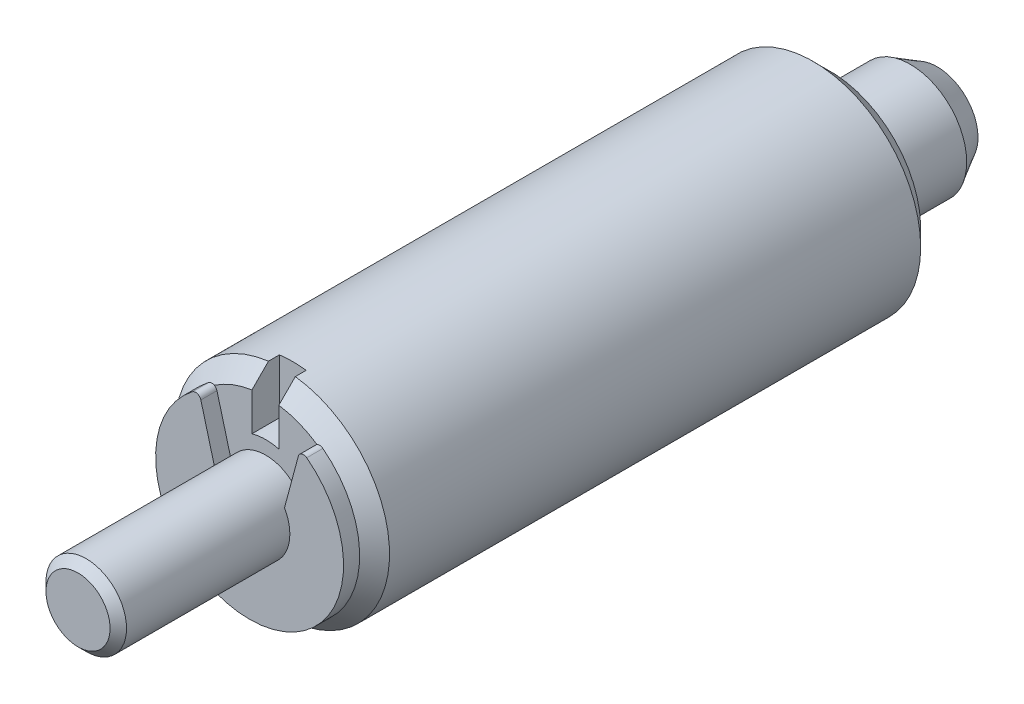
ISO-10303-21;
HEADER;
FILE_DESCRIPTION(('STEP AP214'),'2;1');
FILE_NAME('part.step','',(''),(''),'','','');
FILE_SCHEMA(('AUTOMOTIVE_DESIGN { 1 0 10303 214 1 1 1 1 }'));
ENDSEC;
DATA;
#1=APPLICATION_CONTEXT('core data for automotive mechanical design processes');
#2=APPLICATION_PROTOCOL_DEFINITION('international standard','automotive_design',2000,#1);
#3=PRODUCT_CONTEXT('',#1,'mechanical');
#4=PRODUCT('Part','Part','',(#3));
#5=PRODUCT_RELATED_PRODUCT_CATEGORY('part','',(#4));
#6=PRODUCT_DEFINITION_FORMATION('','',#4);
#7=PRODUCT_DEFINITION_CONTEXT('part definition',#1,'design');
#8=PRODUCT_DEFINITION('design','',#6,#7);
#9=PRODUCT_DEFINITION_SHAPE('','',#8);
#10=(LENGTH_UNIT() NAMED_UNIT(*) SI_UNIT(.MILLI.,.METRE.));
#11=(NAMED_UNIT(*) PLANE_ANGLE_UNIT() SI_UNIT($,.RADIAN.));
#12=(NAMED_UNIT(*) SI_UNIT($,.STERADIAN.) SOLID_ANGLE_UNIT());
#13=UNCERTAINTY_MEASURE_WITH_UNIT(LENGTH_MEASURE(1.E-05),#10,'distance_accuracy_value','');
#14=(GEOMETRIC_REPRESENTATION_CONTEXT(3) GLOBAL_UNCERTAINTY_ASSIGNED_CONTEXT((#13)) GLOBAL_UNIT_ASSIGNED_CONTEXT((#10,
#11,#12)) REPRESENTATION_CONTEXT('',''));
#15=CARTESIAN_POINT('',(0.,0.,0.));
#16=DIRECTION('',(0.,0.,1.));
#17=DIRECTION('',(1.,0.,0.));
#18=AXIS2_PLACEMENT_3D('',#15,#16,#17);
#19=CARTESIAN_POINT('',(-2.00819634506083,2.61861555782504,21.01));
#20=DIRECTION('',(0.,0.,1.));
#21=DIRECTION('',(1.,0.,0.));
#22=AXIS2_PLACEMENT_3D('',#19,#20,#21);
#23=PLANE('',#22);
#24=CARTESIAN_POINT('',(0.,0.,21.01));
#25=DIRECTION('',(0.,0.,1.));
#26=DIRECTION('',(1.,0.,0.));
#27=AXIS2_PLACEMENT_3D('',#24,#25,#26);
#28=CIRCLE('',#27,2.);
#29=CARTESIAN_POINT('',(0.49,-1.939046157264,21.01));
#30=VERTEX_POINT('',#29);
#31=CARTESIAN_POINT('',(-0.51,-1.93388210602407,21.01));
#32=VERTEX_POINT('',#31);
#33=EDGE_CURVE('E9',#30,#32,#28,.F.);
#34=ORIENTED_EDGE('',*,*,#33,.F.);
#35=DIRECTION('',(0.,1.,0.));
#36=VECTOR('',#35,1.);
#37=CARTESIAN_POINT('',(0.49,-3.96987405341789,21.01));
#38=LINE('',#37,#36);
#39=CARTESIAN_POINT('',(0.49,-3.35086291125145,21.01));
#40=VERTEX_POINT('',#39);
#41=EDGE_CURVE('E359',#40,#30,#38,.T.);
#42=ORIENTED_EDGE('',*,*,#41,.F.);
#43=CARTESIAN_POINT('',(0.,0.,21.01));
#44=DIRECTION('',(0.,0.,-1.));
#45=DIRECTION('',(0.,1.,0.));
#46=AXIS2_PLACEMENT_3D('',#43,#44,#45);
#47=CIRCLE('',#46,3.3865);
#48=CARTESIAN_POINT('',(1.9129337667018,2.79447072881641,21.01));
#49=VERTEX_POINT('',#48);
#50=EDGE_CURVE('E174',#49,#40,#47,.T.);
#51=ORIENTED_EDGE('',*,*,#50,.F.);
#52=CARTESIAN_POINT('',(2.00819634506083,2.61861555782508,21.01));
#53=DIRECTION('',(0.,0.,1.));
#54=DIRECTION('',(1.,0.,0.));
#55=AXIS2_PLACEMENT_3D('',#52,#53,#54);
#56=CIRCLE('',#55,0.199999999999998);
#57=CARTESIAN_POINT('',(2.12990521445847,2.7773195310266,21.01));
#58=VERTEX_POINT('',#57);
#59=EDGE_CURVE('E328',#58,#49,#56,.T.);
#60=ORIENTED_EDGE('',*,*,#59,.F.);
#61=CARTESIAN_POINT('',(0.,0.,21.01));
#62=DIRECTION('',(0.,0.,1.));
#63=DIRECTION('',(1.,0.,0.));
#64=AXIS2_PLACEMENT_3D('',#61,#62,#63);
#65=CIRCLE('',#64,3.49999999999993);
#66=CARTESIAN_POINT('',(-2.12990521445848,2.77731953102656,21.01));
#67=VERTEX_POINT('',#66);
#68=EDGE_CURVE('E317',#67,#58,#65,.T.);
#69=ORIENTED_EDGE('',*,*,#68,.F.);
#70=CARTESIAN_POINT('',(-2.00819634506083,2.61861555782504,21.01));
#71=DIRECTION('',(0.,0.,1.));
#72=DIRECTION('',(1.,0.,0.));
#73=AXIS2_PLACEMENT_3D('',#70,#71,#72);
#74=CIRCLE('',#73,0.200000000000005);
#75=CARTESIAN_POINT('',(-1.91293376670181,2.79447072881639,21.01));
#76=VERTEX_POINT('',#75);
#77=EDGE_CURVE('E400',#76,#67,#74,.T.);
#78=ORIENTED_EDGE('',*,*,#77,.F.);
#79=CARTESIAN_POINT('',(0.,0.,21.01));
#80=DIRECTION('',(0.,0.,1.));
#81=DIRECTION('',(1.,0.,0.));
#82=AXIS2_PLACEMENT_3D('',#79,#80,#81);
#83=CIRCLE('',#82,3.3865);
#84=CARTESIAN_POINT('',(-0.51,-3.34787727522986,21.01));
#85=VERTEX_POINT('',#84);
#86=EDGE_CURVE('E37',#85,#76,#83,.F.);
#87=ORIENTED_EDGE('',*,*,#86,.F.);
#88=DIRECTION('',(0.,1.,0.));
#89=VECTOR('',#88,1.);
#90=CARTESIAN_POINT('',(-0.51,-3.96735428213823,21.01));
#91=LINE('',#90,#89);
#92=EDGE_CURVE('E168',#32,#85,#91,.F.);
#93=ORIENTED_EDGE('',*,*,#92,.F.);
#94=EDGE_LOOP('',(#34,#42,#51,#60,#69,#78,#87,#93));
#95=FACE_BOUND('',#94,.T.);
#96=ADVANCED_FACE('F14',(#95),#23,.F.);
#97=CARTESIAN_POINT('',(0.49,1.32202852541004,21.01));
#98=DIRECTION('',(0.,0.,1.));
#99=DIRECTION('',(1.,0.,0.));
#100=AXIS2_PLACEMENT_3D('',#97,#98,#99);
#101=PLANE('',#100);
#102=DIRECTION('',(-0.25881904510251,-0.965925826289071,0.));
#103=VECTOR('',#102,1.);
#104=CARTESIAN_POINT('',(1.30000000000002,0.748331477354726,21.01));
#105=LINE('',#104,#103);
#106=CARTESIAN_POINT('',(1.81501117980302,2.67037936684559,21.01));
#107=VERTEX_POINT('',#106);
#108=CARTESIAN_POINT('',(1.3,0.748331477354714,21.01));
#109=VERTEX_POINT('',#108);
#110=EDGE_CURVE('E334',#107,#109,#105,.T.);
#111=ORIENTED_EDGE('',*,*,#110,.F.);
#112=EDGE_CURVE('E324',#49,#107,#56,.T.);
#113=ORIENTED_EDGE('',*,*,#112,.F.);
#114=CARTESIAN_POINT('',(0.49,3.3508629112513,21.01));
#115=VERTEX_POINT('',#114);
#116=EDGE_CURVE('E22',#115,#49,#47,.T.);
#117=ORIENTED_EDGE('',*,*,#116,.F.);
#118=DIRECTION('',(0.,1.,0.));
#119=VECTOR('',#118,1.);
#120=CARTESIAN_POINT('',(0.49,1.93904615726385,21.01));
#121=LINE('',#120,#119);
#122=CARTESIAN_POINT('',(0.490000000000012,1.9390461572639,21.01));
#123=VERTEX_POINT('',#122);
#124=EDGE_CURVE('E148',#123,#115,#121,.T.);
#125=ORIENTED_EDGE('',*,*,#124,.F.);
#126=CARTESIAN_POINT('',(0.,0.,21.01));
#127=DIRECTION('',(0.,0.,1.));
#128=DIRECTION('',(1.,0.,0.));
#129=AXIS2_PLACEMENT_3D('',#126,#127,#128);
#130=CIRCLE('',#129,2.);
#131=CARTESIAN_POINT('',(-0.510000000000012,1.93388210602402,21.01));
#132=VERTEX_POINT('',#131);
#133=EDGE_CURVE('E133',#123,#132,#130,.T.);
#134=ORIENTED_EDGE('',*,*,#133,.T.);
#135=DIRECTION('',(0.,1.,0.));
#136=VECTOR('',#135,1.);
#137=CARTESIAN_POINT('',(-0.51,1.33412892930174,21.01));
#138=LINE('',#137,#136);
#139=CARTESIAN_POINT('',(-0.51,3.34787727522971,21.01));
#140=VERTEX_POINT('',#139);
#141=EDGE_CURVE('E357',#132,#140,#138,.T.);
#142=ORIENTED_EDGE('',*,*,#141,.T.);
#143=CARTESIAN_POINT('',(0.,0.,21.01));
#144=DIRECTION('',(0.,0.,-1.));
#145=DIRECTION('',(0.,1.,0.));
#146=AXIS2_PLACEMENT_3D('',#143,#144,#145);
#147=CIRCLE('',#146,3.3865);
#148=EDGE_CURVE('E175',#140,#76,#147,.F.);
#149=ORIENTED_EDGE('',*,*,#148,.T.);
#150=CARTESIAN_POINT('',(-1.81501117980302,2.67037936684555,21.01));
#151=VERTEX_POINT('',#150);
#152=EDGE_CURVE('E325',#151,#76,#74,.T.);
#153=ORIENTED_EDGE('',*,*,#152,.F.);
#154=DIRECTION('',(-0.258819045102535,0.965925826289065,0.));
#155=VECTOR('',#154,1.);
#156=CARTESIAN_POINT('',(-1.29999999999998,0.748331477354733,21.01));
#157=LINE('',#156,#155);
#158=CARTESIAN_POINT('',(-1.29999999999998,0.748331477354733,21.01));
#159=VERTEX_POINT('',#158);
#160=EDGE_CURVE('E29',#159,#151,#157,.T.);
#161=ORIENTED_EDGE('',*,*,#160,.F.);
#162=CARTESIAN_POINT('',(0.,0.,21.01));
#163=DIRECTION('',(0.,0.,1.));
#164=DIRECTION('',(1.,0.,0.));
#165=AXIS2_PLACEMENT_3D('',#162,#163,#164);
#166=CIRCLE('',#165,1.5);
#167=EDGE_CURVE('E144',#159,#109,#166,.F.);
#168=ORIENTED_EDGE('',*,*,#167,.T.);
#169=EDGE_LOOP('',(#111,#113,#117,#125,#134,#142,#149,#153,#161,#168));
#170=FACE_BOUND('',#169,.T.);
#171=ADVANCED_FACE('F150',(#170),#101,.T.);
#172=CARTESIAN_POINT('',(1.52264973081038,-1.54092574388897,-4.));
#173=DIRECTION('',(0.,0.,-1.));
#174=DIRECTION('',(-1.,0.,0.));
#175=AXIS2_PLACEMENT_3D('',#172,#173,#174);
#176=PLANE('',#175);
#177=CARTESIAN_POINT('',(0.,0.,-4.));
#178=DIRECTION('',(0.,0.,1.));
#179=DIRECTION('',(0.,-1.,0.));
#180=AXIS2_PLACEMENT_3D('',#177,#178,#179);
#181=CIRCLE('',#180,1.52264973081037);
#182=CARTESIAN_POINT('',(0.,-1.52264973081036,-4.00000000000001));
#183=VERTEX_POINT('',#182);
#184=EDGE_CURVE('E249',#183,#183,#181,.T.);
#185=ORIENTED_EDGE('',*,*,#184,.F.);
#186=EDGE_LOOP('',(#185));
#187=FACE_BOUND('',#186,.T.);
#188=ADVANCED_FACE('F16',(#187),#176,.T.);
#189=CARTESIAN_POINT('',(0.49,1.93904615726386,19.99));
#190=DIRECTION('',(-1.,0.,0.));
#191=DIRECTION('',(0.,0.,1.));
#192=AXIS2_PLACEMENT_3D('',#189,#190,#191);
#193=PLANE('',#192);
#194=DIRECTION('',(0.,0.,-1.));
#195=VECTOR('',#194,1.);
#196=CARTESIAN_POINT('',(0.49,3.96987405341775,20.5));
#197=LINE('',#196,#195);
#198=CARTESIAN_POINT('',(0.49,3.96987405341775,20.3965));
#199=VERTEX_POINT('',#198);
#200=CARTESIAN_POINT('',(0.49,3.96987405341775,19.99));
#201=VERTEX_POINT('',#200);
#202=EDGE_CURVE('E166',#199,#201,#197,.T.);
#203=ORIENTED_EDGE('',*,*,#202,.T.);
#204=DIRECTION('',(0.,1.,0.));
#205=VECTOR('',#204,1.);
#206=CARTESIAN_POINT('',(0.49,1.93388210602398,19.99));
#207=LINE('',#206,#205);
#208=CARTESIAN_POINT('',(0.490000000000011,1.9390461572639,19.99));
#209=VERTEX_POINT('',#208);
#210=EDGE_CURVE('E159',#209,#201,#207,.T.);
#211=ORIENTED_EDGE('',*,*,#210,.F.);
#212=DIRECTION('',(0.,0.,1.));
#213=VECTOR('',#212,1.);
#214=CARTESIAN_POINT('',(0.49,1.93904615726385,20.5));
#215=LINE('',#214,#213);
#216=EDGE_CURVE('E137',#209,#123,#215,.T.);
#217=ORIENTED_EDGE('',*,*,#216,.T.);
#218=ORIENTED_EDGE('',*,*,#124,.T.);
#219=CARTESIAN_POINT('',(0.49,3.3508629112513,21.01));
#220=CARTESIAN_POINT('',(0.49,3.45410806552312,20.9078273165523));
#221=CARTESIAN_POINT('',(0.49,3.5573149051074,20.8056159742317));
#222=CARTESIAN_POINT('',(0.49,3.76365195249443,20.6011159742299));
#223=CARTESIAN_POINT('',(0.49,3.86678216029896,20.4988273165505));
#224=CARTESIAN_POINT('',(0.49,3.96987405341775,20.3965));
#225=B_SPLINE_CURVE_WITH_KNOTS('',3,(#219,#220,#221,#222,#223,#224),.UNSPECIFIED.,.F.,.F.,(4,2,
4),(0.,0.435762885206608,0.871525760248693),.UNSPECIFIED.);
#226=EDGE_CURVE('E155',#115,#199,#225,.T.);
#227=ORIENTED_EDGE('',*,*,#226,.T.);
#228=EDGE_LOOP('',(#203,#211,#217,#218,#227));
#229=FACE_BOUND('',#228,.T.);
#230=ADVANCED_FACE('F157',(#229),#193,.T.);
#231=CARTESIAN_POINT('',(-1.1935,-1.2078262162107,28.));
#232=DIRECTION('',(0.,0.,1.));
#233=DIRECTION('',(1.,0.,0.));
#234=AXIS2_PLACEMENT_3D('',#231,#232,#233);
#235=PLANE('',#234);
#236=CARTESIAN_POINT('',(0.,0.,28.));
#237=DIRECTION('',(0.,0.,-1.));
#238=DIRECTION('',(0.,1.,0.));
#239=AXIS2_PLACEMENT_3D('',#236,#237,#238);
#240=CIRCLE('',#239,1.1935);
#241=CARTESIAN_POINT('',(0.,1.1934999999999,28.));
#242=VERTEX_POINT('',#241);
#243=EDGE_CURVE('E393',#242,#242,#240,.T.);
#244=ORIENTED_EDGE('',*,*,#243,.F.);
#245=EDGE_LOOP('',(#244));
#246=FACE_BOUND('',#245,.T.);
#247=ADVANCED_FACE('F261',(#246),#235,.T.);
#248=CARTESIAN_POINT('',(0.,0.,-4.));
#249=DIRECTION('',(0.,0.,1.));
#250=DIRECTION('',(0.,-1.,0.));
#251=AXIS2_PLACEMENT_3D('',#248,#249,#250);
#252=CONICAL_SURFACE('',#251,1.52264973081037,0.5235987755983);
#253=ORIENTED_EDGE('',*,*,#184,.T.);
#254=EDGE_LOOP('',(#253));
#255=FACE_BOUND('',#254,.T.);
#256=CARTESIAN_POINT('',(0.,0.,-3.));
#257=DIRECTION('',(0.,0.,1.));
#258=DIRECTION('',(1.,0.,0.));
#259=AXIS2_PLACEMENT_3D('',#256,#257,#258);
#260=CIRCLE('',#259,2.1);
#261=CARTESIAN_POINT('',(2.1,0.,-3.));
#262=VERTEX_POINT('',#261);
#263=EDGE_CURVE('E391',#262,#262,#260,.T.);
#264=ORIENTED_EDGE('',*,*,#263,.F.);
#265=EDGE_LOOP('',(#264));
#266=FACE_BOUND('',#265,.T.);
#267=ADVANCED_FACE('F256',(#255,#266),#252,.T.);
#268=CARTESIAN_POINT('',(-0.51,-3.96735428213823,21.01));
#269=DIRECTION('',(1.,0.,0.));
#270=DIRECTION('',(0.,0.,-1.));
#271=AXIS2_PLACEMENT_3D('',#268,#269,#270);
#272=PLANE('',#271);
#273=DIRECTION('',(0.,0.,-1.));
#274=VECTOR('',#273,1.);
#275=CARTESIAN_POINT('',(-0.51,-3.96735428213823,20.5));
#276=LINE('',#275,#274);
#277=CARTESIAN_POINT('',(-0.51,-3.96735428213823,20.3965));
#278=VERTEX_POINT('',#277);
#279=CARTESIAN_POINT('',(-0.51,-3.96735428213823,19.99));
#280=VERTEX_POINT('',#279);
#281=EDGE_CURVE('E246',#278,#280,#276,.T.);
#282=ORIENTED_EDGE('',*,*,#281,.T.);
#283=DIRECTION('',(0.,1.,0.));
#284=VECTOR('',#283,1.);
#285=CARTESIAN_POINT('',(-0.51,-4.00000000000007,19.99));
#286=LINE('',#285,#284);
#287=CARTESIAN_POINT('',(-0.51,-1.93388210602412,19.99));
#288=VERTEX_POINT('',#287);
#289=EDGE_CURVE('E384',#288,#280,#286,.F.);
#290=ORIENTED_EDGE('',*,*,#289,.F.);
#291=DIRECTION('',(0.,0.,1.));
#292=VECTOR('',#291,1.);
#293=CARTESIAN_POINT('',(-0.51,-1.93388210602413,20.5));
#294=LINE('',#293,#292);
#295=EDGE_CURVE('E171',#288,#32,#294,.T.);
#296=ORIENTED_EDGE('',*,*,#295,.T.);
#297=ORIENTED_EDGE('',*,*,#92,.T.);
#298=CARTESIAN_POINT('',(-0.51,-3.34787727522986,21.01));
#299=CARTESIAN_POINT('',(-0.51,-3.45120658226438,20.9078339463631));
#300=CARTESIAN_POINT('',(-0.51,-3.5544943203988,20.8056259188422));
#301=CARTESIAN_POINT('',(-0.51,-3.76098665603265,20.6011259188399));
#302=CARTESIAN_POINT('',(-0.51,-3.86419125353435,20.4988339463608));
#303=CARTESIAN_POINT('',(-0.51,-3.96735428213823,20.3965));
#304=B_SPLINE_CURVE_WITH_KNOTS('',3,(#298,#299,#300,#301,#302,#303),.UNSPECIFIED.,.F.,.F.,(4,2,
4),(0.,0.435928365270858,0.871856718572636),.UNSPECIFIED.);
#305=EDGE_CURVE('E170',#85,#278,#304,.T.);
#306=ORIENTED_EDGE('',*,*,#305,.T.);
#307=EDGE_LOOP('',(#282,#290,#296,#297,#306));
#308=FACE_BOUND('',#307,.T.);
#309=ADVANCED_FACE('F250',(#308),#272,.T.);
#310=CARTESIAN_POINT('',(-0.51,1.92148098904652,19.99));
#311=DIRECTION('',(0.,0.,1.));
#312=DIRECTION('',(1.,0.,0.));
#313=AXIS2_PLACEMENT_3D('',#310,#311,#312);
#314=PLANE('',#313);
#315=CARTESIAN_POINT('',(0.,0.,19.99));
#316=DIRECTION('',(0.,0.,1.));
#317=DIRECTION('',(0.,-1.,0.));
#318=AXIS2_PLACEMENT_3D('',#315,#316,#317);
#319=CIRCLE('',#318,4.);
#320=CARTESIAN_POINT('',(-0.51,3.96735428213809,19.99));
#321=VERTEX_POINT('',#320);
#322=EDGE_CURVE('E394',#201,#321,#319,.T.);
#323=ORIENTED_EDGE('',*,*,#322,.T.);
#324=DIRECTION('',(0.,1.,0.));
#325=VECTOR('',#324,1.);
#326=CARTESIAN_POINT('',(-0.51,1.93388210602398,19.99));
#327=LINE('',#326,#325);
#328=CARTESIAN_POINT('',(-0.51,1.93388210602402,19.99));
#329=VERTEX_POINT('',#328);
#330=EDGE_CURVE('E375',#329,#321,#327,.T.);
#331=ORIENTED_EDGE('',*,*,#330,.F.);
#332=CARTESIAN_POINT('',(0.,0.,19.99));
#333=DIRECTION('',(0.,0.,1.));
#334=DIRECTION('',(0.,-1.,0.));
#335=AXIS2_PLACEMENT_3D('',#332,#333,#334);
#336=CIRCLE('',#335,2.);
#337=EDGE_CURVE('E247',#329,#209,#336,.F.);
#338=ORIENTED_EDGE('',*,*,#337,.T.);
#339=ORIENTED_EDGE('',*,*,#210,.T.);
#340=EDGE_LOOP('',(#323,#331,#338,#339));
#341=FACE_BOUND('',#340,.T.);
#342=ADVANCED_FACE('F255',(#341),#314,.T.);
#343=CARTESIAN_POINT('',(0.,0.,28.));
#344=DIRECTION('',(0.,0.,-1.));
#345=DIRECTION('',(0.,1.,0.));
#346=AXIS2_PLACEMENT_3D('',#343,#344,#345);
#347=CONICAL_SURFACE('',#346,1.1935,0.785398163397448);
#348=ORIENTED_EDGE('',*,*,#243,.T.);
#349=EDGE_LOOP('',(#348));
#350=FACE_BOUND('',#349,.T.);
#351=CARTESIAN_POINT('',(0.,0.,27.6935));
#352=DIRECTION('',(0.,0.,1.));
#353=DIRECTION('',(1.,0.,0.));
#354=AXIS2_PLACEMENT_3D('',#351,#352,#353);
#355=CIRCLE('',#354,1.5);
#356=CARTESIAN_POINT('',(1.5,0.,27.6935));
#357=VERTEX_POINT('',#356);
#358=EDGE_CURVE('E224',#357,#357,#355,.F.);
#359=ORIENTED_EDGE('',*,*,#358,.F.);
#360=EDGE_LOOP('',(#359));
#361=FACE_BOUND('',#360,.T.);
#362=ADVANCED_FACE('F436',(#350,#361),#347,.T.);
#363=CARTESIAN_POINT('',(0.,0.,0.));
#364=DIRECTION('',(0.,0.,1.));
#365=DIRECTION('',(0.,-1.,0.));
#366=AXIS2_PLACEMENT_3D('',#363,#364,#365);
#367=CYLINDRICAL_SURFACE('',#366,2.1);
#368=ORIENTED_EDGE('',*,*,#263,.T.);
#369=EDGE_LOOP('',(#368));
#370=FACE_BOUND('',#369,.T.);
#371=CARTESIAN_POINT('',(0.,0.,0.));
#372=DIRECTION('',(0.,0.,1.));
#373=DIRECTION('',(0.,-1.,0.));
#374=AXIS2_PLACEMENT_3D('',#371,#372,#373);
#375=CIRCLE('',#374,2.1);
#376=CARTESIAN_POINT('',(0.,-2.1,0.));
#377=VERTEX_POINT('',#376);
#378=EDGE_CURVE('E226',#377,#377,#375,.T.);
#379=ORIENTED_EDGE('',*,*,#378,.F.);
#380=EDGE_LOOP('',(#379));
#381=FACE_BOUND('',#380,.T.);
#382=ADVANCED_FACE('F439',(#370,#381),#367,.T.);
#383=CARTESIAN_POINT('',(-0.51,-4.01313605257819,19.99));
#384=DIRECTION('',(0.,0.,1.));
#385=DIRECTION('',(1.,0.,0.));
#386=AXIS2_PLACEMENT_3D('',#383,#384,#385);
#387=PLANE('',#386);
#388=CARTESIAN_POINT('',(0.,0.,19.99));
#389=DIRECTION('',(0.,0.,1.));
#390=DIRECTION('',(0.,-1.,0.));
#391=AXIS2_PLACEMENT_3D('',#388,#389,#390);
#392=CIRCLE('',#391,4.);
#393=CARTESIAN_POINT('',(0.49,-3.96987405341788,19.99));
#394=VERTEX_POINT('',#393);
#395=EDGE_CURVE('E227',#280,#394,#392,.T.);
#396=ORIENTED_EDGE('',*,*,#395,.T.);
#397=DIRECTION('',(0.,1.,0.));
#398=VECTOR('',#397,1.);
#399=CARTESIAN_POINT('',(0.49,-3.96987405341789,19.99));
#400=LINE('',#399,#398);
#401=CARTESIAN_POINT('',(0.49,-1.939046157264,19.99));
#402=VERTEX_POINT('',#401);
#403=EDGE_CURVE('E362',#402,#394,#400,.F.);
#404=ORIENTED_EDGE('',*,*,#403,.F.);
#405=CARTESIAN_POINT('',(0.,0.,19.99));
#406=DIRECTION('',(0.,0.,1.));
#407=DIRECTION('',(0.,-1.,0.));
#408=AXIS2_PLACEMENT_3D('',#405,#406,#407);
#409=CIRCLE('',#408,2.);
#410=EDGE_CURVE('E387',#402,#288,#409,.F.);
#411=ORIENTED_EDGE('',*,*,#410,.T.);
#412=ORIENTED_EDGE('',*,*,#289,.T.);
#413=EDGE_LOOP('',(#396,#404,#411,#412));
#414=FACE_BOUND('',#413,.T.);
#415=ADVANCED_FACE('F213',(#414),#387,.T.);
#416=CARTESIAN_POINT('',(-0.51,1.93388210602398,21.01));
#417=DIRECTION('',(1.,0.,0.));
#418=DIRECTION('',(0.,0.,-1.));
#419=AXIS2_PLACEMENT_3D('',#416,#417,#418);
#420=PLANE('',#419);
#421=CARTESIAN_POINT('',(-0.51,3.96735428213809,20.3965));
#422=CARTESIAN_POINT('',(-0.51,3.86419125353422,20.4988339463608));
#423=CARTESIAN_POINT('',(-0.51,3.76098665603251,20.6011259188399));
#424=CARTESIAN_POINT('',(-0.51,3.55449432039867,20.8056259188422));
#425=CARTESIAN_POINT('',(-0.51,3.45120658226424,20.9078339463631));
#426=CARTESIAN_POINT('',(-0.51,3.34787727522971,21.01));
#427=B_SPLINE_CURVE_WITH_KNOTS('',3,(#421,#422,#423,#424,#425,#426),.UNSPECIFIED.,.F.,.F.,(4,2,
4),(0.,0.43592835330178,0.87185671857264),.UNSPECIFIED.);
#428=CARTESIAN_POINT('',(-0.51,3.96735428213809,20.3965));
#429=VERTEX_POINT('',#428);
#430=EDGE_CURVE('E217',#429,#140,#427,.T.);
#431=ORIENTED_EDGE('',*,*,#430,.T.);
#432=ORIENTED_EDGE('',*,*,#141,.F.);
#433=DIRECTION('',(0.,0.,-1.));
#434=VECTOR('',#433,1.);
#435=CARTESIAN_POINT('',(-0.51,1.93388210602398,20.5));
#436=LINE('',#435,#434);
#437=EDGE_CURVE('E140',#132,#329,#436,.T.);
#438=ORIENTED_EDGE('',*,*,#437,.T.);
#439=ORIENTED_EDGE('',*,*,#330,.T.);
#440=DIRECTION('',(0.,0.,1.));
#441=VECTOR('',#440,1.);
#442=CARTESIAN_POINT('',(-0.51,3.96735428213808,20.5));
#443=LINE('',#442,#441);
#444=EDGE_CURVE('E225',#321,#429,#443,.T.);
#445=ORIENTED_EDGE('',*,*,#444,.T.);
#446=EDGE_LOOP('',(#431,#432,#438,#439,#445));
#447=FACE_BOUND('',#446,.T.);
#448=ADVANCED_FACE('F208',(#447),#420,.T.);
#449=CARTESIAN_POINT('',(0.,0.,27.6935));
#450=DIRECTION('',(0.,0.,1.));
#451=DIRECTION('',(0.,-1.,0.));
#452=AXIS2_PLACEMENT_3D('',#449,#450,#451);
#453=CYLINDRICAL_SURFACE('',#452,1.5);
#454=ORIENTED_EDGE('',*,*,#167,.F.);
#455=DIRECTION('',(0.,0.,-1.));
#456=VECTOR('',#455,1.);
#457=CARTESIAN_POINT('',(-1.29999999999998,0.748331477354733,21.61));
#458=LINE('',#457,#456);
#459=CARTESIAN_POINT('',(-1.29999999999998,0.748331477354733,21.61));
#460=VERTEX_POINT('',#459);
#461=EDGE_CURVE('E344',#460,#159,#458,.T.);
#462=ORIENTED_EDGE('',*,*,#461,.F.);
#463=CARTESIAN_POINT('',(0.,0.,21.61));
#464=DIRECTION('',(0.,0.,-1.));
#465=DIRECTION('',(1.,0.,0.));
#466=AXIS2_PLACEMENT_3D('',#463,#464,#465);
#467=CIRCLE('',#466,1.5);
#468=CARTESIAN_POINT('',(1.30000000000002,0.748331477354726,21.61));
#469=VERTEX_POINT('',#468);
#470=EDGE_CURVE('E404',#469,#460,#467,.T.);
#471=ORIENTED_EDGE('',*,*,#470,.F.);
#472=DIRECTION('',(0.,0.,-1.));
#473=VECTOR('',#472,1.);
#474=CARTESIAN_POINT('',(1.30000000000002,0.748331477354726,21.61));
#475=LINE('',#474,#473);
#476=EDGE_CURVE('E347',#469,#109,#475,.T.);
#477=ORIENTED_EDGE('',*,*,#476,.T.);
#478=EDGE_LOOP('',(#454,#462,#471,#477));
#479=FACE_BOUND('',#478,.T.);
#480=ORIENTED_EDGE('',*,*,#358,.T.);
#481=EDGE_LOOP('',(#480));
#482=FACE_BOUND('',#481,.T.);
#483=ADVANCED_FACE('F204',(#479,#482),#453,.T.);
#484=CARTESIAN_POINT('',(3.3865,-3.42714010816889,0.));
#485=DIRECTION('',(0.,0.,-1.));
#486=DIRECTION('',(-1.,0.,0.));
#487=AXIS2_PLACEMENT_3D('',#484,#485,#486);
#488=PLANE('',#487);
#489=ORIENTED_EDGE('',*,*,#378,.T.);
#490=EDGE_LOOP('',(#489));
#491=FACE_BOUND('',#490,.T.);
#492=CARTESIAN_POINT('',(0.,0.,0.));
#493=DIRECTION('',(0.,0.,1.));
#494=DIRECTION('',(0.,-1.,0.));
#495=AXIS2_PLACEMENT_3D('',#492,#493,#494);
#496=CIRCLE('',#495,3.3865);
#497=CARTESIAN_POINT('',(0.,-3.3865,0.));
#498=VERTEX_POINT('',#497);
#499=EDGE_CURVE('E190',#498,#498,#496,.T.);
#500=ORIENTED_EDGE('',*,*,#499,.F.);
#501=EDGE_LOOP('',(#500));
#502=FACE_BOUND('',#501,.T.);
#503=ADVANCED_FACE('F200',(#491,#502),#488,.T.);
#504=CARTESIAN_POINT('',(0.49,-3.96987405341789,19.99));
#505=DIRECTION('',(-1.,0.,0.));
#506=DIRECTION('',(0.,0.,1.));
#507=AXIS2_PLACEMENT_3D('',#504,#505,#506);
#508=PLANE('',#507);
#509=CARTESIAN_POINT('',(0.49,-3.35086291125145,21.01));
#510=CARTESIAN_POINT('',(0.49,-3.45410806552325,20.9078273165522));
#511=CARTESIAN_POINT('',(0.49,-3.55731490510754,20.8056159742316));
#512=CARTESIAN_POINT('',(0.49,-3.76365195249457,20.6011159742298));
#513=CARTESIAN_POINT('',(0.49,-3.8667821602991,20.4988273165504));
#514=CARTESIAN_POINT('',(0.49,-3.96987405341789,20.3965));
#515=B_SPLINE_CURVE_WITH_KNOTS('',3,(#509,#510,#511,#512,#513,#514),.UNSPECIFIED.,.F.,.F.,(4,2,
4),(0.,0.435762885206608,0.871525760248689),.UNSPECIFIED.);
#516=CARTESIAN_POINT('',(0.49,-3.96987405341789,20.3965));
#517=VERTEX_POINT('',#516);
#518=EDGE_CURVE('E179',#40,#517,#515,.T.);
#519=ORIENTED_EDGE('',*,*,#518,.F.);
#520=ORIENTED_EDGE('',*,*,#41,.T.);
#521=DIRECTION('',(0.,0.,-1.));
#522=VECTOR('',#521,1.);
#523=CARTESIAN_POINT('',(0.49,-1.939046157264,20.5));
#524=LINE('',#523,#522);
#525=EDGE_CURVE('E371',#30,#402,#524,.T.);
#526=ORIENTED_EDGE('',*,*,#525,.T.);
#527=ORIENTED_EDGE('',*,*,#403,.T.);
#528=DIRECTION('',(0.,0.,-1.));
#529=VECTOR('',#528,1.);
#530=CARTESIAN_POINT('',(0.49,-3.96987405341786,10.505));
#531=LINE('',#530,#529);
#532=EDGE_CURVE('E189',#517,#394,#531,.T.);
#533=ORIENTED_EDGE('',*,*,#532,.F.);
#534=EDGE_LOOP('',(#519,#520,#526,#527,#533));
#535=FACE_BOUND('',#534,.T.);
#536=ADVANCED_FACE('F195',(#535),#508,.T.);
#537=CARTESIAN_POINT('',(0.,0.,0.));
#538=DIRECTION('',(0.,0.,1.));
#539=DIRECTION('',(0.,-1.,0.));
#540=AXIS2_PLACEMENT_3D('',#537,#538,#539);
#541=CONICAL_SURFACE('',#540,3.3865,0.785398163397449);
#542=ORIENTED_EDGE('',*,*,#499,.T.);
#543=EDGE_LOOP('',(#542));
#544=FACE_BOUND('',#543,.T.);
#545=CARTESIAN_POINT('',(0.,0.,0.613499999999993));
#546=DIRECTION('',(0.,0.,1.));
#547=DIRECTION('',(1.,0.,0.));
#548=AXIS2_PLACEMENT_3D('',#545,#546,#547);
#549=CIRCLE('',#548,4.);
#550=CARTESIAN_POINT('',(4.,0.,0.613499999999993));
#551=VERTEX_POINT('',#550);
#552=EDGE_CURVE('E188',#551,#551,#549,.T.);
#553=ORIENTED_EDGE('',*,*,#552,.F.);
#554=EDGE_LOOP('',(#553));
#555=FACE_BOUND('',#554,.T.);
#556=ADVANCED_FACE('F199',(#544,#555),#541,.T.);
#557=CARTESIAN_POINT('',(0.,0.,21.01));
#558=DIRECTION('',(0.,0.,-1.));
#559=DIRECTION('',(0.,1.,0.));
#560=AXIS2_PLACEMENT_3D('',#557,#558,#559);
#561=CONICAL_SURFACE('',#560,3.3865,0.78539816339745);
#562=ORIENTED_EDGE('',*,*,#305,.F.);
#563=ORIENTED_EDGE('',*,*,#86,.T.);
#564=ORIENTED_EDGE('',*,*,#148,.F.);
#565=ORIENTED_EDGE('',*,*,#430,.F.);
#566=CARTESIAN_POINT('',(0.,0.,20.3965));
#567=DIRECTION('',(0.,0.,1.));
#568=DIRECTION('',(1.,0.,0.));
#569=AXIS2_PLACEMENT_3D('',#566,#567,#568);
#570=CIRCLE('',#569,4.);
#571=EDGE_CURVE('E178',#278,#429,#570,.F.);
#572=ORIENTED_EDGE('',*,*,#571,.F.);
#573=EDGE_LOOP('',(#562,#563,#564,#565,#572));
#574=FACE_BOUND('',#573,.T.);
#575=ADVANCED_FACE('F231',(#574),#561,.T.);
#576=CARTESIAN_POINT('',(0.,0.,20.3965));
#577=DIRECTION('',(0.,0.,1.));
#578=DIRECTION('',(0.,-1.,0.));
#579=AXIS2_PLACEMENT_3D('',#576,#577,#578);
#580=CYLINDRICAL_SURFACE('',#579,4.);
#581=ORIENTED_EDGE('',*,*,#552,.T.);
#582=EDGE_LOOP('',(#581));
#583=FACE_BOUND('',#582,.T.);
#584=ORIENTED_EDGE('',*,*,#202,.F.);
#585=CARTESIAN_POINT('',(0.,0.,20.3965));
#586=DIRECTION('',(0.,0.,1.));
#587=DIRECTION('',(1.,0.,0.));
#588=AXIS2_PLACEMENT_3D('',#585,#586,#587);
#589=CIRCLE('',#588,4.);
#590=EDGE_CURVE('E177',#517,#199,#589,.T.);
#591=ORIENTED_EDGE('',*,*,#590,.F.);
#592=ORIENTED_EDGE('',*,*,#532,.T.);
#593=ORIENTED_EDGE('',*,*,#395,.F.);
#594=ORIENTED_EDGE('',*,*,#281,.F.);
#595=ORIENTED_EDGE('',*,*,#571,.T.);
#596=ORIENTED_EDGE('',*,*,#444,.F.);
#597=ORIENTED_EDGE('',*,*,#322,.F.);
#598=EDGE_LOOP('',(#584,#591,#592,#593,#594,#595,#596,#597));
#599=FACE_BOUND('',#598,.T.);
#600=ADVANCED_FACE('F235',(#583,#599),#580,.T.);
#601=CARTESIAN_POINT('',(0.,0.,21.01));
#602=DIRECTION('',(0.,0.,-1.));
#603=DIRECTION('',(0.,1.,0.));
#604=AXIS2_PLACEMENT_3D('',#601,#602,#603);
#605=CONICAL_SURFACE('',#604,3.3865,0.78539816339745);
#606=ORIENTED_EDGE('',*,*,#116,.T.);
#607=ORIENTED_EDGE('',*,*,#50,.T.);
#608=ORIENTED_EDGE('',*,*,#518,.T.);
#609=ORIENTED_EDGE('',*,*,#590,.T.);
#610=ORIENTED_EDGE('',*,*,#226,.F.);
#611=EDGE_LOOP('',(#606,#607,#608,#609,#610));
#612=FACE_BOUND('',#611,.T.);
#613=ADVANCED_FACE('F272',(#612),#605,.T.);
#614=CARTESIAN_POINT('',(-2.00819634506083,2.61861555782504,21.61));
#615=DIRECTION('',(0.,0.,-1.));
#616=DIRECTION('',(-1.,0.,0.));
#617=AXIS2_PLACEMENT_3D('',#614,#615,#616);
#618=CYLINDRICAL_SURFACE('',#617,0.200000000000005);
#619=ORIENTED_EDGE('',*,*,#152,.T.);
#620=ORIENTED_EDGE('',*,*,#77,.T.);
#621=DIRECTION('',(0.,0.,-1.));
#622=VECTOR('',#621,1.);
#623=CARTESIAN_POINT('',(-2.12990521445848,2.77731953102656,21.61));
#624=LINE('',#623,#622);
#625=CARTESIAN_POINT('',(-2.12990521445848,2.77731953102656,21.61));
#626=VERTEX_POINT('',#625);
#627=EDGE_CURVE('E162',#626,#67,#624,.T.);
#628=ORIENTED_EDGE('',*,*,#627,.F.);
#629=CARTESIAN_POINT('',(-2.00819634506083,2.61861555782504,21.61));
#630=DIRECTION('',(0.,0.,1.));
#631=DIRECTION('',(1.,0.,0.));
#632=AXIS2_PLACEMENT_3D('',#629,#630,#631);
#633=CIRCLE('',#632,0.200000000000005);
#634=CARTESIAN_POINT('',(-1.81501117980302,2.67037936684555,21.61));
#635=VERTEX_POINT('',#634);
#636=EDGE_CURVE('E340',#635,#626,#633,.T.);
#637=ORIENTED_EDGE('',*,*,#636,.F.);
#638=DIRECTION('',(0.,0.,-1.));
#639=VECTOR('',#638,1.);
#640=CARTESIAN_POINT('',(-1.81501117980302,2.67037936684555,21.61));
#641=LINE('',#640,#639);
#642=EDGE_CURVE('E341',#635,#151,#641,.T.);
#643=ORIENTED_EDGE('',*,*,#642,.T.);
#644=EDGE_LOOP('',(#619,#620,#628,#637,#643));
#645=FACE_BOUND('',#644,.T.);
#646=ADVANCED_FACE('F276',(#645),#618,.T.);
#647=CARTESIAN_POINT('',(0.,0.,21.61));
#648=DIRECTION('',(0.,0.,-1.));
#649=DIRECTION('',(-1.,0.,0.));
#650=AXIS2_PLACEMENT_3D('',#647,#648,#649);
#651=CYLINDRICAL_SURFACE('',#650,3.49999999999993);
#652=ORIENTED_EDGE('',*,*,#68,.T.);
#653=DIRECTION('',(0.,0.,-1.));
#654=VECTOR('',#653,1.);
#655=CARTESIAN_POINT('',(2.12990521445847,2.7773195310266,21.61));
#656=LINE('',#655,#654);
#657=CARTESIAN_POINT('',(2.12990521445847,2.7773195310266,21.61));
#658=VERTEX_POINT('',#657);
#659=EDGE_CURVE('E319',#658,#58,#656,.T.);
#660=ORIENTED_EDGE('',*,*,#659,.F.);
#661=CARTESIAN_POINT('',(0.,0.,21.61));
#662=DIRECTION('',(0.,0.,1.));
#663=DIRECTION('',(1.,0.,0.));
#664=AXIS2_PLACEMENT_3D('',#661,#662,#663);
#665=CIRCLE('',#664,3.49999999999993);
#666=EDGE_CURVE('E409',#626,#658,#665,.T.);
#667=ORIENTED_EDGE('',*,*,#666,.F.);
#668=ORIENTED_EDGE('',*,*,#627,.T.);
#669=EDGE_LOOP('',(#652,#660,#667,#668));
#670=FACE_BOUND('',#669,.T.);
#671=ADVANCED_FACE('F305',(#670),#651,.T.);
#672=CARTESIAN_POINT('',(2.00819634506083,2.61861555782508,21.61));
#673=DIRECTION('',(0.,0.,-1.));
#674=DIRECTION('',(-1.,0.,0.));
#675=AXIS2_PLACEMENT_3D('',#672,#673,#674);
#676=CYLINDRICAL_SURFACE('',#675,0.199999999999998);
#677=ORIENTED_EDGE('',*,*,#59,.T.);
#678=ORIENTED_EDGE('',*,*,#112,.T.);
#679=DIRECTION('',(0.,0.,-1.));
#680=VECTOR('',#679,1.);
#681=CARTESIAN_POINT('',(1.81501117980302,2.67037936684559,21.61));
#682=LINE('',#681,#680);
#683=CARTESIAN_POINT('',(1.81501117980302,2.67037936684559,21.61));
#684=VERTEX_POINT('',#683);
#685=EDGE_CURVE('E331',#684,#107,#682,.T.);
#686=ORIENTED_EDGE('',*,*,#685,.F.);
#687=CARTESIAN_POINT('',(2.00819634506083,2.61861555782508,21.61));
#688=DIRECTION('',(0.,0.,1.));
#689=DIRECTION('',(1.,0.,0.));
#690=AXIS2_PLACEMENT_3D('',#687,#688,#689);
#691=CIRCLE('',#690,0.199999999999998);
#692=EDGE_CURVE('E330',#658,#684,#691,.T.);
#693=ORIENTED_EDGE('',*,*,#692,.F.);
#694=ORIENTED_EDGE('',*,*,#659,.T.);
#695=EDGE_LOOP('',(#677,#678,#686,#693,#694));
#696=FACE_BOUND('',#695,.T.);
#697=ADVANCED_FACE('F302',(#696),#676,.T.);
#698=CARTESIAN_POINT('',(1.30000000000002,0.748331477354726,21.61));
#699=DIRECTION('',(0.965925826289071,-0.25881904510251,0.));
#700=DIRECTION('',(0.25881904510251,0.965925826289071,0.));
#701=AXIS2_PLACEMENT_3D('',#698,#699,#700);
#702=PLANE('',#701);
#703=ORIENTED_EDGE('',*,*,#110,.T.);
#704=ORIENTED_EDGE('',*,*,#476,.F.);
#705=DIRECTION('',(-0.25881904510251,-0.965925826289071,0.));
#706=VECTOR('',#705,1.);
#707=CARTESIAN_POINT('',(1.30000000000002,0.748331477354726,21.61));
#708=LINE('',#707,#706);
#709=EDGE_CURVE('E406',#684,#469,#708,.T.);
#710=ORIENTED_EDGE('',*,*,#709,.F.);
#711=ORIENTED_EDGE('',*,*,#685,.T.);
#712=EDGE_LOOP('',(#703,#704,#710,#711));
#713=FACE_BOUND('',#712,.T.);
#714=ADVANCED_FACE('F299',(#713),#702,.F.);
#715=CARTESIAN_POINT('',(-1.29999999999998,0.748331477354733,21.61));
#716=DIRECTION('',(-0.965925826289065,-0.258819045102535,0.));
#717=DIRECTION('',(0.258819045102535,-0.965925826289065,0.));
#718=AXIS2_PLACEMENT_3D('',#715,#716,#717);
#719=PLANE('',#718);
#720=ORIENTED_EDGE('',*,*,#160,.T.);
#721=ORIENTED_EDGE('',*,*,#642,.F.);
#722=DIRECTION('',(-0.258819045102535,0.965925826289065,0.));
#723=VECTOR('',#722,1.);
#724=CARTESIAN_POINT('',(-1.29999999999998,0.748331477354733,21.61));
#725=LINE('',#724,#723);
#726=EDGE_CURVE('E345',#460,#635,#725,.T.);
#727=ORIENTED_EDGE('',*,*,#726,.F.);
#728=ORIENTED_EDGE('',*,*,#461,.T.);
#729=EDGE_LOOP('',(#720,#721,#727,#728));
#730=FACE_BOUND('',#729,.T.);
#731=ADVANCED_FACE('F296',(#730),#719,.F.);
#732=CARTESIAN_POINT('',(-2.00819634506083,2.61861555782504,21.61));
#733=DIRECTION('',(0.,0.,1.));
#734=DIRECTION('',(1.,0.,0.));
#735=AXIS2_PLACEMENT_3D('',#732,#733,#734);
#736=PLANE('',#735);
#737=ORIENTED_EDGE('',*,*,#636,.T.);
#738=ORIENTED_EDGE('',*,*,#666,.T.);
#739=ORIENTED_EDGE('',*,*,#692,.T.);
#740=ORIENTED_EDGE('',*,*,#709,.T.);
#741=ORIENTED_EDGE('',*,*,#470,.T.);
#742=ORIENTED_EDGE('',*,*,#726,.T.);
#743=EDGE_LOOP('',(#737,#738,#739,#740,#741,#742));
#744=FACE_BOUND('',#743,.T.);
#745=ADVANCED_FACE('F294',(#744),#736,.T.);
#746=CARTESIAN_POINT('',(0.,0.,26.6668542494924));
#747=DIRECTION('',(0.,0.,-1.));
#748=DIRECTION('',(-1.,0.,0.));
#749=AXIS2_PLACEMENT_3D('',#746,#747,#748);
#750=CYLINDRICAL_SURFACE('',#749,2.);
#751=ORIENTED_EDGE('',*,*,#295,.F.);
#752=ORIENTED_EDGE('',*,*,#410,.F.);
#753=ORIENTED_EDGE('',*,*,#525,.F.);
#754=ORIENTED_EDGE('',*,*,#33,.T.);
#755=EDGE_LOOP('',(#751,#752,#753,#754));
#756=FACE_BOUND('',#755,.T.);
#757=ADVANCED_FACE('F429',(#756),#750,.T.);
#758=ORIENTED_EDGE('',*,*,#216,.F.);
#759=ORIENTED_EDGE('',*,*,#337,.F.);
#760=ORIENTED_EDGE('',*,*,#437,.F.);
#761=ORIENTED_EDGE('',*,*,#133,.F.);
#762=EDGE_LOOP('',(#758,#759,#760,#761));
#763=FACE_BOUND('',#762,.T.);
#764=ADVANCED_FACE('F135',(#763),#750,.T.);
#765=CLOSED_SHELL('',(#96,#171,#188,#230,#247,#267,#309,#342,#362,#382,#415,#448,#483,#503,#536,
#556,#575,#600,#613,#646,#671,#697,#714,#731,#745,#757,#764));
#766=MANIFOLD_SOLID_BREP('B1',#765);
#767=ADVANCED_BREP_SHAPE_REPRESENTATION('',(#18,#766),#14);
#768=SHAPE_DEFINITION_REPRESENTATION(#9,#767);
ENDSEC;
END-ISO-10303-21;
